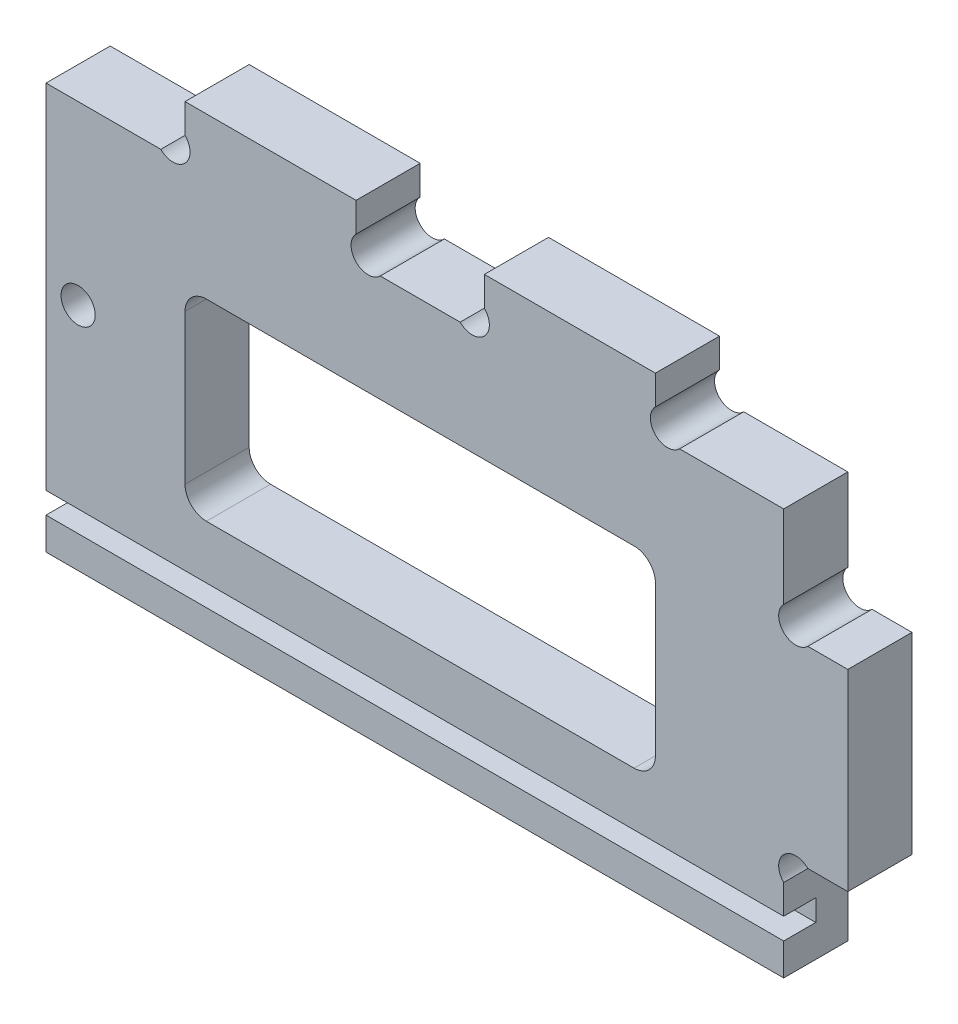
from build123d import *

# Parameters (mm, degrees)
ESQUISSE1_R             = 1.6
EXTRUSION1_DEPTH        = 6
ESQUISSE2_W             = 69
ESQUISSE2_H             = 2
ENL_V_MAT_EXTRU_1_DEPTH = 3


with BuildPart() as part:
    # Esquisse1 → Extrusion1 (new body)
    with BuildSketch(Plane.XY):
        with BuildLine():
            Line((32, 40.2627417), (32, 43))
            Line((32, 43), (16, 43))
            Line((16, 43), (16, 40.2627417))
            ThreePointArc((16, 40.2627417), (16, 38), (13.7372583, 38))
            Line((13.7372583, 38), (6.2627417, 38))
            ThreePointArc((6.2627417, 38), (4, 38), (4, 40.2627417))
            Line((4, 40.2627417), (4, 43))
            Line((4, 43), (-12, 43))
            Line((-12, 43), (-12, 40.2627417))
            ThreePointArc((-12, 40.2627417), (-12, 38), (-14.2627417, 38))
            Line((-14.2627417, 38), (-25, 38))
            Line((-25, 38), (-25, 0))
            Line((-25, 0), (44, 0))
            Line((44, 0), (44, 7.7372583))
            ThreePointArc((44, 7.7372583), (44, 10), (46.2627417, 10))
            Line((46.2627417, 10), (50, 10))
            Line((50, 10), (50, 28))
            Line((50, 28), (46.2627417, 28))
            ThreePointArc((46.2627417, 28), (44, 28), (44, 30.2627417))
            Line((44, 30.2627417), (44, 38))
            Line((44, 38), (34.2627417, 38))
            ThreePointArc((34.2627417, 38), (32, 38), (32, 40.2627417))
        make_face()
        with Locations((-22, 21.5)):
            Circle(ESQUISSE1_R, mode=Mode.SUBTRACT)
        with BuildLine():
            Line((-10, 28), (30, 28))
            ThreePointArc((30, 28), (31.414213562, 27.414213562), (32, 26))
            Line((32, 26), (32, 12))
            ThreePointArc((32, 12), (31.414213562, 10.585786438), (30, 10))
            Line((30, 10), (-10, 10))
            ThreePointArc((-10, 10), (-11.414213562, 10.585786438), (-12, 12))
            Line((-12, 12), (-12, 26))
            ThreePointArc((-12, 26), (-11.414213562, 27.414213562), (-10, 28))
        make_face(mode=Mode.SUBTRACT)
    extrude(amount=EXTRUSION1_DEPTH)

    # Esquisse2 → Enl_v. mat.-Extru.1 (cut)
    with BuildSketch(Plane.XY.offset(6)):
        with Locations((9.5, 4)):
            Rectangle(ESQUISSE2_W, ESQUISSE2_H)
    extrude(amount=-ENL_V_MAT_EXTRU_1_DEPTH, mode=Mode.SUBTRACT)


solid = part.part
